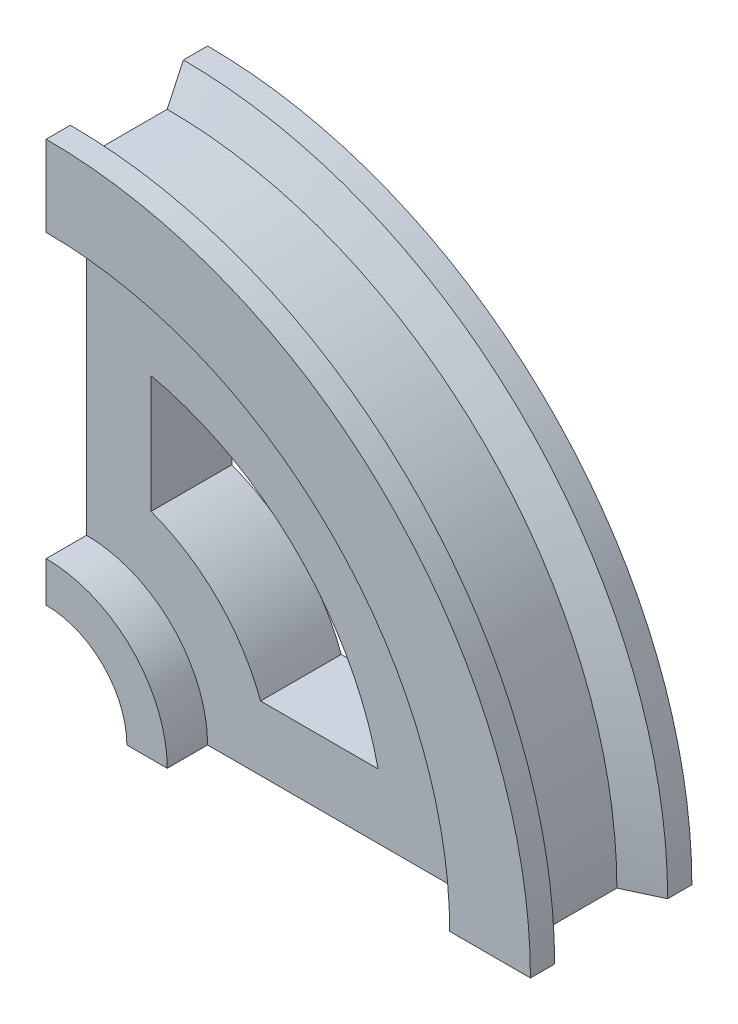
ISO-10303-21;
HEADER;
FILE_DESCRIPTION(('STEP AP214'),'2;1');
FILE_NAME('part.step','',(''),(''),'','','');
FILE_SCHEMA(('AUTOMOTIVE_DESIGN { 1 0 10303 214 1 1 1 1 }'));
ENDSEC;
DATA;
#1=APPLICATION_CONTEXT('core data for automotive mechanical design processes');
#2=APPLICATION_PROTOCOL_DEFINITION('international standard','automotive_design',2000,#1);
#3=PRODUCT_CONTEXT('',#1,'mechanical');
#4=PRODUCT('Part','Part','',(#3));
#5=PRODUCT_RELATED_PRODUCT_CATEGORY('part','',(#4));
#6=PRODUCT_DEFINITION_FORMATION('','',#4);
#7=PRODUCT_DEFINITION_CONTEXT('part definition',#1,'design');
#8=PRODUCT_DEFINITION('design','',#6,#7);
#9=PRODUCT_DEFINITION_SHAPE('','',#8);
#10=(LENGTH_UNIT() NAMED_UNIT(*) SI_UNIT(.MILLI.,.METRE.));
#11=(NAMED_UNIT(*) PLANE_ANGLE_UNIT() SI_UNIT($,.RADIAN.));
#12=(NAMED_UNIT(*) SI_UNIT($,.STERADIAN.) SOLID_ANGLE_UNIT());
#13=UNCERTAINTY_MEASURE_WITH_UNIT(LENGTH_MEASURE(1.E-05),#10,'distance_accuracy_value','');
#14=(GEOMETRIC_REPRESENTATION_CONTEXT(3) GLOBAL_UNCERTAINTY_ASSIGNED_CONTEXT((#13)) GLOBAL_UNIT_ASSIGNED_CONTEXT((#10,
#11,#12)) REPRESENTATION_CONTEXT('',''));
#15=CARTESIAN_POINT('',(0.,0.,0.));
#16=DIRECTION('',(0.,0.,1.));
#17=DIRECTION('',(1.,0.,0.));
#18=AXIS2_PLACEMENT_3D('',#15,#16,#17);
#19=CARTESIAN_POINT('',(15.,0.,10.));
#20=DIRECTION('',(0.,0.,-1.));
#21=DIRECTION('',(-1.,0.,0.));
#22=AXIS2_PLACEMENT_3D('',#19,#20,#21);
#23=PLANE('',#22);
#24=CARTESIAN_POINT('',(0.,0.,10.));
#25=DIRECTION('',(0.,0.,1.));
#26=DIRECTION('',(1.,0.,0.));
#27=AXIS2_PLACEMENT_3D('',#24,#25,#26);
#28=CIRCLE('',#27,10.);
#29=CARTESIAN_POINT('',(10.,0.,10.));
#30=VERTEX_POINT('',#29);
#31=CARTESIAN_POINT('',(0.,10.,10.));
#32=VERTEX_POINT('',#31);
#33=EDGE_CURVE('E11',#30,#32,#28,.T.);
#34=ORIENTED_EDGE('',*,*,#33,.F.);
#35=DIRECTION('',(-1.,0.,0.));
#36=VECTOR('',#35,1.);
#37=CARTESIAN_POINT('',(15.,0.,10.));
#38=LINE('',#37,#36);
#39=CARTESIAN_POINT('',(15.,0.,10.));
#40=VERTEX_POINT('',#39);
#41=EDGE_CURVE('E262',#40,#30,#38,.T.);
#42=ORIENTED_EDGE('',*,*,#41,.F.);
#43=CARTESIAN_POINT('',(0.,0.,10.));
#44=DIRECTION('',(0.,0.,1.));
#45=DIRECTION('',(1.,0.,0.));
#46=AXIS2_PLACEMENT_3D('',#43,#44,#45);
#47=CIRCLE('',#46,15.);
#48=CARTESIAN_POINT('',(0.,15.,10.));
#49=VERTEX_POINT('',#48);
#50=EDGE_CURVE('E310',#40,#49,#47,.T.);
#51=ORIENTED_EDGE('',*,*,#50,.T.);
#52=DIRECTION('',(0.,-1.,0.));
#53=VECTOR('',#52,1.);
#54=CARTESIAN_POINT('',(0.,15.,10.));
#55=LINE('',#54,#53);
#56=EDGE_CURVE('E211',#49,#32,#55,.T.);
#57=ORIENTED_EDGE('',*,*,#56,.T.);
#58=EDGE_LOOP('',(#34,#42,#51,#57));
#59=FACE_BOUND('',#58,.T.);
#60=ADVANCED_FACE('F42',(#59),#23,.F.);
#61=CARTESIAN_POINT('',(0.,0.,25.7403142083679));
#62=DIRECTION('',(0.,0.,1.));
#63=DIRECTION('',(1.,0.,0.));
#64=AXIS2_PLACEMENT_3D('',#61,#62,#63);
#65=CYLINDRICAL_SURFACE('',#64,10.);
#66=CARTESIAN_POINT('',(0.,0.,-10.));
#67=DIRECTION('',(0.,0.,1.));
#68=DIRECTION('',(1.,0.,0.));
#69=AXIS2_PLACEMENT_3D('',#66,#67,#68);
#70=CIRCLE('',#69,10.);
#71=CARTESIAN_POINT('',(10.,0.,-10.));
#72=VERTEX_POINT('',#71);
#73=CARTESIAN_POINT('',(0.,10.,-10.));
#74=VERTEX_POINT('',#73);
#75=EDGE_CURVE('E50',#72,#74,#70,.T.);
#76=ORIENTED_EDGE('',*,*,#75,.F.);
#77=DIRECTION('',(0.,0.,-1.));
#78=VECTOR('',#77,1.);
#79=CARTESIAN_POINT('',(10.,0.,10.));
#80=LINE('',#79,#78);
#81=EDGE_CURVE('E265',#30,#72,#80,.T.);
#82=ORIENTED_EDGE('',*,*,#81,.F.);
#83=ORIENTED_EDGE('',*,*,#33,.T.);
#84=DIRECTION('',(0.,0.,-1.));
#85=VECTOR('',#84,1.);
#86=CARTESIAN_POINT('',(0.,10.,10.));
#87=LINE('',#86,#85);
#88=EDGE_CURVE('E217',#32,#74,#87,.T.);
#89=ORIENTED_EDGE('',*,*,#88,.T.);
#90=EDGE_LOOP('',(#76,#82,#83,#89));
#91=FACE_BOUND('',#90,.T.);
#92=ADVANCED_FACE('F44',(#91),#65,.F.);
#93=CARTESIAN_POINT('',(15.,0.,-10.));
#94=DIRECTION('',(0.,0.,1.));
#95=DIRECTION('',(1.,0.,0.));
#96=AXIS2_PLACEMENT_3D('',#93,#94,#95);
#97=PLANE('',#96);
#98=CARTESIAN_POINT('',(0.,0.,-10.));
#99=DIRECTION('',(0.,0.,1.));
#100=DIRECTION('',(1.,0.,0.));
#101=AXIS2_PLACEMENT_3D('',#98,#99,#100);
#102=CIRCLE('',#101,15.);
#103=CARTESIAN_POINT('',(15.,0.,-10.));
#104=VERTEX_POINT('',#103);
#105=CARTESIAN_POINT('',(0.,15.,-10.));
#106=VERTEX_POINT('',#105);
#107=EDGE_CURVE('E336',#104,#106,#102,.T.);
#108=ORIENTED_EDGE('',*,*,#107,.F.);
#109=DIRECTION('',(1.,0.,0.));
#110=VECTOR('',#109,1.);
#111=CARTESIAN_POINT('',(15.,0.,-10.));
#112=LINE('',#111,#110);
#113=EDGE_CURVE('E268',#72,#104,#112,.T.);
#114=ORIENTED_EDGE('',*,*,#113,.F.);
#115=ORIENTED_EDGE('',*,*,#75,.T.);
#116=DIRECTION('',(0.,1.,0.));
#117=VECTOR('',#116,1.);
#118=CARTESIAN_POINT('',(0.,15.,-10.));
#119=LINE('',#118,#117);
#120=EDGE_CURVE('E220',#74,#106,#119,.T.);
#121=ORIENTED_EDGE('',*,*,#120,.T.);
#122=EDGE_LOOP('',(#108,#114,#115,#121));
#123=FACE_BOUND('',#122,.T.);
#124=ADVANCED_FACE('F339',(#123),#97,.F.);
#125=CARTESIAN_POINT('',(0.,0.,25.7403142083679));
#126=DIRECTION('',(0.,0.,1.));
#127=DIRECTION('',(1.,0.,0.));
#128=AXIS2_PLACEMENT_3D('',#125,#126,#127);
#129=CYLINDRICAL_SURFACE('',#128,15.);
#130=CARTESIAN_POINT('',(0.,0.,-5.));
#131=DIRECTION('',(0.,0.,1.));
#132=DIRECTION('',(1.,0.,0.));
#133=AXIS2_PLACEMENT_3D('',#130,#131,#132);
#134=CIRCLE('',#133,15.);
#135=CARTESIAN_POINT('',(15.,0.,-5.));
#136=VERTEX_POINT('',#135);
#137=CARTESIAN_POINT('',(0.,15.,-5.));
#138=VERTEX_POINT('',#137);
#139=EDGE_CURVE('E334',#136,#138,#134,.T.);
#140=ORIENTED_EDGE('',*,*,#139,.F.);
#141=DIRECTION('',(0.,0.,1.));
#142=VECTOR('',#141,1.);
#143=CARTESIAN_POINT('',(15.,0.,-5.));
#144=LINE('',#143,#142);
#145=EDGE_CURVE('E271',#104,#136,#144,.T.);
#146=ORIENTED_EDGE('',*,*,#145,.F.);
#147=ORIENTED_EDGE('',*,*,#107,.T.);
#148=DIRECTION('',(0.,0.,1.));
#149=VECTOR('',#148,1.);
#150=CARTESIAN_POINT('',(0.,15.,-5.));
#151=LINE('',#150,#149);
#152=EDGE_CURVE('E223',#106,#138,#151,.T.);
#153=ORIENTED_EDGE('',*,*,#152,.T.);
#154=EDGE_LOOP('',(#140,#146,#147,#153));
#155=FACE_BOUND('',#154,.T.);
#156=ADVANCED_FACE('F351',(#155),#129,.T.);
#157=CARTESIAN_POINT('',(15.,0.,-5.));
#158=DIRECTION('',(0.,0.,1.));
#159=DIRECTION('',(1.,0.,0.));
#160=AXIS2_PLACEMENT_3D('',#157,#158,#159);
#161=PLANE('',#160);
#162=DIRECTION('',(-1.,0.,0.));
#163=VECTOR('',#162,1.);
#164=CARTESIAN_POINT('',(36.1247837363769,7.99999999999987,-5.));
#165=LINE('',#164,#163);
#166=CARTESIAN_POINT('',(36.1247837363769,7.99999999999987,-5.));
#167=VERTEX_POINT('',#166);
#168=CARTESIAN_POINT('',(21.5638586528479,7.99999999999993,-5.));
#169=VERTEX_POINT('',#168);
#170=EDGE_CURVE('E205',#167,#169,#165,.T.);
#171=ORIENTED_EDGE('',*,*,#170,.F.);
#172=CARTESIAN_POINT('',(0.,0.,-5.));
#173=DIRECTION('',(0.,0.,-1.));
#174=DIRECTION('',(-1.,0.,0.));
#175=AXIS2_PLACEMENT_3D('',#172,#173,#174);
#176=CIRCLE('',#175,37.);
#177=CARTESIAN_POINT('',(8.,36.1247837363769,-5.));
#178=VERTEX_POINT('',#177);
#179=EDGE_CURVE('E57',#178,#167,#176,.T.);
#180=ORIENTED_EDGE('',*,*,#179,.F.);
#181=DIRECTION('',(0.,1.,0.));
#182=VECTOR('',#181,1.);
#183=CARTESIAN_POINT('',(8.,21.5638586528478,-5.));
#184=LINE('',#183,#182);
#185=CARTESIAN_POINT('',(8.,21.5638586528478,-5.));
#186=VERTEX_POINT('',#185);
#187=EDGE_CURVE('E196',#186,#178,#184,.T.);
#188=ORIENTED_EDGE('',*,*,#187,.F.);
#189=CARTESIAN_POINT('',(0.,0.,-5.));
#190=DIRECTION('',(0.,0.,1.));
#191=DIRECTION('',(-1.,0.,0.));
#192=AXIS2_PLACEMENT_3D('',#189,#190,#191);
#193=CIRCLE('',#192,23.);
#194=EDGE_CURVE('E199',#169,#186,#193,.T.);
#195=ORIENTED_EDGE('',*,*,#194,.F.);
#196=EDGE_LOOP('',(#171,#180,#188,#195));
#197=FACE_BOUND('',#196,.T.);
#198=CARTESIAN_POINT('',(0.,0.,-5.));
#199=DIRECTION('',(0.,0.,1.));
#200=DIRECTION('',(1.,0.,0.));
#201=AXIS2_PLACEMENT_3D('',#198,#199,#200);
#202=CIRCLE('',#201,45.);
#203=CARTESIAN_POINT('',(45.,-1.57116660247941E-13,-5.));
#204=VERTEX_POINT('',#203);
#205=CARTESIAN_POINT('',(0.,45.,-5.));
#206=VERTEX_POINT('',#205);
#207=EDGE_CURVE('E332',#204,#206,#202,.T.);
#208=ORIENTED_EDGE('',*,*,#207,.F.);
#209=DIRECTION('',(1.,0.,0.));
#210=VECTOR('',#209,1.);
#211=CARTESIAN_POINT('',(15.,0.,-5.));
#212=LINE('',#211,#210);
#213=EDGE_CURVE('E274',#136,#204,#212,.T.);
#214=ORIENTED_EDGE('',*,*,#213,.F.);
#215=ORIENTED_EDGE('',*,*,#139,.T.);
#216=DIRECTION('',(0.,1.,0.));
#217=VECTOR('',#216,1.);
#218=CARTESIAN_POINT('',(0.,15.,-5.));
#219=LINE('',#218,#217);
#220=EDGE_CURVE('E226',#138,#206,#219,.T.);
#221=ORIENTED_EDGE('',*,*,#220,.T.);
#222=EDGE_LOOP('',(#208,#214,#215,#221));
#223=FACE_BOUND('',#222,.T.);
#224=ADVANCED_FACE('F400',(#197,#223),#161,.F.);
#225=CARTESIAN_POINT('',(0.,0.,-5.));
#226=DIRECTION('',(0.,0.,-1.));
#227=DIRECTION('',(-1.,0.,0.));
#228=AXIS2_PLACEMENT_3D('',#225,#226,#227);
#229=CONICAL_SURFACE('',#228,45.,0.785398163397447);
#230=CARTESIAN_POINT('',(0.,0.,-10.));
#231=DIRECTION('',(0.,0.,1.));
#232=DIRECTION('',(1.,0.,0.));
#233=AXIS2_PLACEMENT_3D('',#230,#231,#232);
#234=CIRCLE('',#233,50.);
#235=CARTESIAN_POINT('',(50.,-1.74574066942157E-13,-10.));
#236=VERTEX_POINT('',#235);
#237=CARTESIAN_POINT('',(0.,50.,-10.));
#238=VERTEX_POINT('',#237);
#239=EDGE_CURVE('E330',#236,#238,#234,.T.);
#240=ORIENTED_EDGE('',*,*,#239,.F.);
#241=DIRECTION('',(0.707106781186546,0.,-0.707106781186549));
#242=VECTOR('',#241,1.);
#243=CARTESIAN_POINT('',(45.,-1.57116660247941E-13,-5.));
#244=LINE('',#243,#242);
#245=EDGE_CURVE('E277',#204,#236,#244,.T.);
#246=ORIENTED_EDGE('',*,*,#245,.F.);
#247=ORIENTED_EDGE('',*,*,#207,.T.);
#248=DIRECTION('',(0.,0.707106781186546,-0.707106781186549));
#249=VECTOR('',#248,1.);
#250=CARTESIAN_POINT('',(0.,45.,-5.));
#251=LINE('',#250,#249);
#252=EDGE_CURVE('E229',#206,#238,#251,.T.);
#253=ORIENTED_EDGE('',*,*,#252,.T.);
#254=EDGE_LOOP('',(#240,#246,#247,#253));
#255=FACE_BOUND('',#254,.T.);
#256=ADVANCED_FACE('F398',(#255),#229,.F.);
#257=CARTESIAN_POINT('',(50.,-1.74574066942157E-13,-10.));
#258=DIRECTION('',(0.,0.,1.));
#259=DIRECTION('',(1.,0.,0.));
#260=AXIS2_PLACEMENT_3D('',#257,#258,#259);
#261=PLANE('',#260);
#262=CARTESIAN_POINT('',(0.,0.,-10.));
#263=DIRECTION('',(0.,0.,1.));
#264=DIRECTION('',(1.,0.,0.));
#265=AXIS2_PLACEMENT_3D('',#262,#263,#264);
#266=CIRCLE('',#265,60.);
#267=CARTESIAN_POINT('',(60.,-2.09488880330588E-13,-10.));
#268=VERTEX_POINT('',#267);
#269=CARTESIAN_POINT('',(0.,60.,-10.));
#270=VERTEX_POINT('',#269);
#271=EDGE_CURVE('E328',#268,#270,#266,.T.);
#272=ORIENTED_EDGE('',*,*,#271,.F.);
#273=DIRECTION('',(1.,0.,0.));
#274=VECTOR('',#273,1.);
#275=CARTESIAN_POINT('',(50.,-1.74574066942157E-13,-10.));
#276=LINE('',#275,#274);
#277=EDGE_CURVE('E280',#236,#268,#276,.T.);
#278=ORIENTED_EDGE('',*,*,#277,.F.);
#279=ORIENTED_EDGE('',*,*,#239,.T.);
#280=DIRECTION('',(0.,1.,0.));
#281=VECTOR('',#280,1.);
#282=CARTESIAN_POINT('',(0.,50.,-10.));
#283=LINE('',#282,#281);
#284=EDGE_CURVE('E232',#238,#270,#283,.T.);
#285=ORIENTED_EDGE('',*,*,#284,.T.);
#286=EDGE_LOOP('',(#272,#278,#279,#285));
#287=FACE_BOUND('',#286,.T.);
#288=ADVANCED_FACE('F395',(#287),#261,.F.);
#289=CARTESIAN_POINT('',(0.,0.,25.7403142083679));
#290=DIRECTION('',(0.,0.,1.));
#291=DIRECTION('',(1.,0.,0.));
#292=AXIS2_PLACEMENT_3D('',#289,#290,#291);
#293=CYLINDRICAL_SURFACE('',#292,60.);
#294=CARTESIAN_POINT('',(0.,0.,-7.00000000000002));
#295=DIRECTION('',(0.,0.,1.));
#296=DIRECTION('',(1.,0.,0.));
#297=AXIS2_PLACEMENT_3D('',#294,#295,#296);
#298=CIRCLE('',#297,60.);
#299=CARTESIAN_POINT('',(60.,-2.09488880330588E-13,-7.00000000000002));
#300=VERTEX_POINT('',#299);
#301=CARTESIAN_POINT('',(0.,60.,-7.00000000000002));
#302=VERTEX_POINT('',#301);
#303=EDGE_CURVE('E326',#300,#302,#298,.T.);
#304=ORIENTED_EDGE('',*,*,#303,.F.);
#305=DIRECTION('',(0.,0.,1.));
#306=VECTOR('',#305,1.);
#307=CARTESIAN_POINT('',(60.,-2.09488880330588E-13,-10.));
#308=LINE('',#307,#306);
#309=EDGE_CURVE('E283',#268,#300,#308,.T.);
#310=ORIENTED_EDGE('',*,*,#309,.F.);
#311=ORIENTED_EDGE('',*,*,#271,.T.);
#312=DIRECTION('',(0.,0.,1.));
#313=VECTOR('',#312,1.);
#314=CARTESIAN_POINT('',(0.,60.,-10.));
#315=LINE('',#314,#313);
#316=EDGE_CURVE('E235',#270,#302,#315,.T.);
#317=ORIENTED_EDGE('',*,*,#316,.T.);
#318=EDGE_LOOP('',(#304,#310,#311,#317));
#319=FACE_BOUND('',#318,.T.);
#320=ADVANCED_FACE('F391',(#319),#293,.T.);
#321=CARTESIAN_POINT('',(0.,0.,-7.00000000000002));
#322=DIRECTION('',(0.,0.,-1.));
#323=DIRECTION('',(-1.,0.,0.));
#324=AXIS2_PLACEMENT_3D('',#321,#322,#323);
#325=CONICAL_SURFACE('',#324,60.,1.13446401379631);
#326=CARTESIAN_POINT('',(0.,0.,-5.));
#327=DIRECTION('',(0.,0.,1.));
#328=DIRECTION('',(1.,0.,0.));
#329=AXIS2_PLACEMENT_3D('',#326,#327,#328);
#330=CIRCLE('',#329,55.7109861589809);
#331=CARTESIAN_POINT('',(55.7109861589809,-1.9451386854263E-13,-5.));
#332=VERTEX_POINT('',#331);
#333=CARTESIAN_POINT('',(0.,55.7109861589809,-5.));
#334=VERTEX_POINT('',#333);
#335=EDGE_CURVE('E324',#332,#334,#330,.T.);
#336=ORIENTED_EDGE('',*,*,#335,.F.);
#337=DIRECTION('',(-0.906307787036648,0.,0.422618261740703));
#338=VECTOR('',#337,1.);
#339=CARTESIAN_POINT('',(60.,-2.09488880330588E-13,-7.00000000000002));
#340=LINE('',#339,#338);
#341=EDGE_CURVE('E286',#300,#332,#340,.T.);
#342=ORIENTED_EDGE('',*,*,#341,.F.);
#343=ORIENTED_EDGE('',*,*,#303,.T.);
#344=DIRECTION('',(0.,-0.906307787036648,0.422618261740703));
#345=VECTOR('',#344,1.);
#346=CARTESIAN_POINT('',(0.,60.,-7.00000000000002));
#347=LINE('',#346,#345);
#348=EDGE_CURVE('E238',#302,#334,#347,.T.);
#349=ORIENTED_EDGE('',*,*,#348,.T.);
#350=EDGE_LOOP('',(#336,#342,#343,#349));
#351=FACE_BOUND('',#350,.T.);
#352=ADVANCED_FACE('F387',(#351),#325,.T.);
#353=CARTESIAN_POINT('',(0.,0.,25.7403142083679));
#354=DIRECTION('',(0.,0.,1.));
#355=DIRECTION('',(1.,0.,0.));
#356=AXIS2_PLACEMENT_3D('',#353,#354,#355);
#357=CYLINDRICAL_SURFACE('',#356,55.7109861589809);
#358=CARTESIAN_POINT('',(0.,0.,5.));
#359=DIRECTION('',(0.,0.,1.));
#360=DIRECTION('',(1.,0.,0.));
#361=AXIS2_PLACEMENT_3D('',#358,#359,#360);
#362=CIRCLE('',#361,55.7109861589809);
#363=CARTESIAN_POINT('',(55.7109861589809,-1.9451386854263E-13,5.));
#364=VERTEX_POINT('',#363);
#365=CARTESIAN_POINT('',(0.,55.7109861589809,5.));
#366=VERTEX_POINT('',#365);
#367=EDGE_CURVE('E322',#364,#366,#362,.T.);
#368=ORIENTED_EDGE('',*,*,#367,.F.);
#369=DIRECTION('',(0.,0.,1.));
#370=VECTOR('',#369,1.);
#371=CARTESIAN_POINT('',(55.7109861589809,-1.9451386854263E-13,5.));
#372=LINE('',#371,#370);
#373=EDGE_CURVE('E289',#332,#364,#372,.T.);
#374=ORIENTED_EDGE('',*,*,#373,.F.);
#375=ORIENTED_EDGE('',*,*,#335,.T.);
#376=DIRECTION('',(0.,0.,1.));
#377=VECTOR('',#376,1.);
#378=CARTESIAN_POINT('',(0.,55.7109861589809,5.));
#379=LINE('',#378,#377);
#380=EDGE_CURVE('E241',#334,#366,#379,.T.);
#381=ORIENTED_EDGE('',*,*,#380,.T.);
#382=EDGE_LOOP('',(#368,#374,#375,#381));
#383=FACE_BOUND('',#382,.T.);
#384=ADVANCED_FACE('F384',(#383),#357,.T.);
#385=CARTESIAN_POINT('',(0.,0.,5.));
#386=DIRECTION('',(0.,0.,1.));
#387=DIRECTION('',(1.,0.,0.));
#388=AXIS2_PLACEMENT_3D('',#385,#386,#387);
#389=CONICAL_SURFACE('',#388,55.7109861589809,1.13446401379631);
#390=CARTESIAN_POINT('',(0.,0.,7.00000000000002));
#391=DIRECTION('',(0.,0.,1.));
#392=DIRECTION('',(1.,0.,0.));
#393=AXIS2_PLACEMENT_3D('',#390,#391,#392);
#394=CIRCLE('',#393,60.);
#395=CARTESIAN_POINT('',(60.,-2.09488880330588E-13,7.00000000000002));
#396=VERTEX_POINT('',#395);
#397=CARTESIAN_POINT('',(0.,60.,7.00000000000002));
#398=VERTEX_POINT('',#397);
#399=EDGE_CURVE('E320',#396,#398,#394,.T.);
#400=ORIENTED_EDGE('',*,*,#399,.F.);
#401=DIRECTION('',(0.906307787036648,0.,0.422618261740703));
#402=VECTOR('',#401,1.);
#403=CARTESIAN_POINT('',(60.,-2.09488880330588E-13,7.00000000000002));
#404=LINE('',#403,#402);
#405=EDGE_CURVE('E292',#364,#396,#404,.T.);
#406=ORIENTED_EDGE('',*,*,#405,.F.);
#407=ORIENTED_EDGE('',*,*,#367,.T.);
#408=DIRECTION('',(0.,0.906307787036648,0.422618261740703));
#409=VECTOR('',#408,1.);
#410=CARTESIAN_POINT('',(0.,60.,7.00000000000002));
#411=LINE('',#410,#409);
#412=EDGE_CURVE('E244',#366,#398,#411,.T.);
#413=ORIENTED_EDGE('',*,*,#412,.T.);
#414=EDGE_LOOP('',(#400,#406,#407,#413));
#415=FACE_BOUND('',#414,.T.);
#416=ADVANCED_FACE('F380',(#415),#389,.T.);
#417=CARTESIAN_POINT('',(0.,0.,25.7403142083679));
#418=DIRECTION('',(0.,0.,1.));
#419=DIRECTION('',(1.,0.,0.));
#420=AXIS2_PLACEMENT_3D('',#417,#418,#419);
#421=CYLINDRICAL_SURFACE('',#420,60.);
#422=CARTESIAN_POINT('',(0.,0.,10.));
#423=DIRECTION('',(0.,0.,1.));
#424=DIRECTION('',(1.,0.,0.));
#425=AXIS2_PLACEMENT_3D('',#422,#423,#424);
#426=CIRCLE('',#425,60.);
#427=CARTESIAN_POINT('',(60.,-2.09488880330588E-13,10.));
#428=VERTEX_POINT('',#427);
#429=CARTESIAN_POINT('',(0.,60.,10.));
#430=VERTEX_POINT('',#429);
#431=EDGE_CURVE('E318',#428,#430,#426,.T.);
#432=ORIENTED_EDGE('',*,*,#431,.F.);
#433=DIRECTION('',(0.,0.,1.));
#434=VECTOR('',#433,1.);
#435=CARTESIAN_POINT('',(60.,-2.09488880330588E-13,10.));
#436=LINE('',#435,#434);
#437=EDGE_CURVE('E295',#396,#428,#436,.T.);
#438=ORIENTED_EDGE('',*,*,#437,.F.);
#439=ORIENTED_EDGE('',*,*,#399,.T.);
#440=DIRECTION('',(0.,0.,1.));
#441=VECTOR('',#440,1.);
#442=CARTESIAN_POINT('',(0.,60.,10.));
#443=LINE('',#442,#441);
#444=EDGE_CURVE('E247',#398,#430,#443,.T.);
#445=ORIENTED_EDGE('',*,*,#444,.T.);
#446=EDGE_LOOP('',(#432,#438,#439,#445));
#447=FACE_BOUND('',#446,.T.);
#448=ADVANCED_FACE('F375',(#447),#421,.T.);
#449=CARTESIAN_POINT('',(50.,-1.74574066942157E-13,10.));
#450=DIRECTION('',(0.,0.,-1.));
#451=DIRECTION('',(-1.,0.,0.));
#452=AXIS2_PLACEMENT_3D('',#449,#450,#451);
#453=PLANE('',#452);
#454=CARTESIAN_POINT('',(0.,0.,10.));
#455=DIRECTION('',(0.,0.,1.));
#456=DIRECTION('',(1.,0.,0.));
#457=AXIS2_PLACEMENT_3D('',#454,#455,#456);
#458=CIRCLE('',#457,50.);
#459=CARTESIAN_POINT('',(50.,-1.74574066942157E-13,10.));
#460=VERTEX_POINT('',#459);
#461=CARTESIAN_POINT('',(0.,50.,10.));
#462=VERTEX_POINT('',#461);
#463=EDGE_CURVE('E316',#460,#462,#458,.T.);
#464=ORIENTED_EDGE('',*,*,#463,.F.);
#465=DIRECTION('',(-1.,0.,0.));
#466=VECTOR('',#465,1.);
#467=CARTESIAN_POINT('',(50.,-1.74574066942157E-13,10.));
#468=LINE('',#467,#466);
#469=EDGE_CURVE('E298',#428,#460,#468,.T.);
#470=ORIENTED_EDGE('',*,*,#469,.F.);
#471=ORIENTED_EDGE('',*,*,#431,.T.);
#472=DIRECTION('',(0.,-1.,0.));
#473=VECTOR('',#472,1.);
#474=CARTESIAN_POINT('',(0.,50.,10.));
#475=LINE('',#474,#473);
#476=EDGE_CURVE('E250',#430,#462,#475,.T.);
#477=ORIENTED_EDGE('',*,*,#476,.T.);
#478=EDGE_LOOP('',(#464,#470,#471,#477));
#479=FACE_BOUND('',#478,.T.);
#480=ADVANCED_FACE('F372',(#479),#453,.F.);
#481=CARTESIAN_POINT('',(0.,0.,10.));
#482=DIRECTION('',(0.,0.,1.));
#483=DIRECTION('',(1.,0.,0.));
#484=AXIS2_PLACEMENT_3D('',#481,#482,#483);
#485=CONICAL_SURFACE('',#484,50.,0.785398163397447);
#486=CARTESIAN_POINT('',(0.,0.,5.));
#487=DIRECTION('',(0.,0.,1.));
#488=DIRECTION('',(1.,0.,0.));
#489=AXIS2_PLACEMENT_3D('',#486,#487,#488);
#490=CIRCLE('',#489,45.);
#491=CARTESIAN_POINT('',(45.,-1.57116660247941E-13,5.));
#492=VERTEX_POINT('',#491);
#493=CARTESIAN_POINT('',(0.,45.,5.));
#494=VERTEX_POINT('',#493);
#495=EDGE_CURVE('E314',#492,#494,#490,.T.);
#496=ORIENTED_EDGE('',*,*,#495,.F.);
#497=DIRECTION('',(-0.707106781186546,0.,-0.707106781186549));
#498=VECTOR('',#497,1.);
#499=CARTESIAN_POINT('',(45.,-1.57116660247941E-13,5.));
#500=LINE('',#499,#498);
#501=EDGE_CURVE('E301',#460,#492,#500,.T.);
#502=ORIENTED_EDGE('',*,*,#501,.F.);
#503=ORIENTED_EDGE('',*,*,#463,.T.);
#504=DIRECTION('',(0.,-0.707106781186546,-0.707106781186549));
#505=VECTOR('',#504,1.);
#506=CARTESIAN_POINT('',(0.,45.,5.));
#507=LINE('',#506,#505);
#508=EDGE_CURVE('E253',#462,#494,#507,.T.);
#509=ORIENTED_EDGE('',*,*,#508,.T.);
#510=EDGE_LOOP('',(#496,#502,#503,#509));
#511=FACE_BOUND('',#510,.T.);
#512=ADVANCED_FACE('F368',(#511),#485,.F.);
#513=CARTESIAN_POINT('',(15.,0.,5.));
#514=DIRECTION('',(0.,0.,-1.));
#515=DIRECTION('',(-1.,0.,0.));
#516=AXIS2_PLACEMENT_3D('',#513,#514,#515);
#517=PLANE('',#516);
#518=DIRECTION('',(0.,1.,0.));
#519=VECTOR('',#518,1.);
#520=CARTESIAN_POINT('',(8.,21.5638586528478,5.));
#521=LINE('',#520,#519);
#522=CARTESIAN_POINT('',(8.,21.5638586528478,5.));
#523=VERTEX_POINT('',#522);
#524=CARTESIAN_POINT('',(8.,36.1247837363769,5.));
#525=VERTEX_POINT('',#524);
#526=EDGE_CURVE('E186',#523,#525,#521,.T.);
#527=ORIENTED_EDGE('',*,*,#526,.T.);
#528=CARTESIAN_POINT('',(0.,0.,5.));
#529=DIRECTION('',(0.,0.,-1.));
#530=DIRECTION('',(-1.,0.,0.));
#531=AXIS2_PLACEMENT_3D('',#528,#529,#530);
#532=CIRCLE('',#531,37.);
#533=CARTESIAN_POINT('',(36.1247837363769,7.99999999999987,5.));
#534=VERTEX_POINT('',#533);
#535=EDGE_CURVE('E180',#525,#534,#532,.T.);
#536=ORIENTED_EDGE('',*,*,#535,.T.);
#537=DIRECTION('',(-1.,0.,0.));
#538=VECTOR('',#537,1.);
#539=CARTESIAN_POINT('',(36.1247837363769,7.99999999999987,5.));
#540=LINE('',#539,#538);
#541=CARTESIAN_POINT('',(21.5638586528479,7.99999999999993,5.));
#542=VERTEX_POINT('',#541);
#543=EDGE_CURVE('E189',#534,#542,#540,.T.);
#544=ORIENTED_EDGE('',*,*,#543,.T.);
#545=CARTESIAN_POINT('',(0.,0.,5.));
#546=DIRECTION('',(0.,0.,1.));
#547=DIRECTION('',(-1.,0.,0.));
#548=AXIS2_PLACEMENT_3D('',#545,#546,#547);
#549=CIRCLE('',#548,23.);
#550=EDGE_CURVE('E65',#542,#523,#549,.T.);
#551=ORIENTED_EDGE('',*,*,#550,.T.);
#552=EDGE_LOOP('',(#527,#536,#544,#551));
#553=FACE_BOUND('',#552,.T.);
#554=CARTESIAN_POINT('',(0.,0.,5.));
#555=DIRECTION('',(0.,0.,1.));
#556=DIRECTION('',(1.,0.,0.));
#557=AXIS2_PLACEMENT_3D('',#554,#555,#556);
#558=CIRCLE('',#557,15.);
#559=CARTESIAN_POINT('',(15.,0.,5.));
#560=VERTEX_POINT('',#559);
#561=CARTESIAN_POINT('',(0.,15.,5.));
#562=VERTEX_POINT('',#561);
#563=EDGE_CURVE('E312',#560,#562,#558,.T.);
#564=ORIENTED_EDGE('',*,*,#563,.F.);
#565=DIRECTION('',(-1.,0.,0.));
#566=VECTOR('',#565,1.);
#567=CARTESIAN_POINT('',(15.,0.,5.));
#568=LINE('',#567,#566);
#569=EDGE_CURVE('E304',#492,#560,#568,.T.);
#570=ORIENTED_EDGE('',*,*,#569,.F.);
#571=ORIENTED_EDGE('',*,*,#495,.T.);
#572=DIRECTION('',(0.,-1.,0.));
#573=VECTOR('',#572,1.);
#574=CARTESIAN_POINT('',(0.,15.,5.));
#575=LINE('',#574,#573);
#576=EDGE_CURVE('E256',#494,#562,#575,.T.);
#577=ORIENTED_EDGE('',*,*,#576,.T.);
#578=EDGE_LOOP('',(#564,#570,#571,#577));
#579=FACE_BOUND('',#578,.T.);
#580=ADVANCED_FACE('F193',(#553,#579),#517,.F.);
#581=CARTESIAN_POINT('',(0.,0.,25.7403142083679));
#582=DIRECTION('',(0.,0.,1.));
#583=DIRECTION('',(1.,0.,0.));
#584=AXIS2_PLACEMENT_3D('',#581,#582,#583);
#585=CYLINDRICAL_SURFACE('',#584,15.);
#586=DIRECTION('',(0.,0.,1.));
#587=VECTOR('',#586,1.);
#588=CARTESIAN_POINT('',(15.,0.,10.));
#589=LINE('',#588,#587);
#590=EDGE_CURVE('E307',#560,#40,#589,.T.);
#591=ORIENTED_EDGE('',*,*,#590,.F.);
#592=ORIENTED_EDGE('',*,*,#563,.T.);
#593=DIRECTION('',(0.,0.,1.));
#594=VECTOR('',#593,1.);
#595=CARTESIAN_POINT('',(0.,15.,10.));
#596=LINE('',#595,#594);
#597=EDGE_CURVE('E259',#562,#49,#596,.T.);
#598=ORIENTED_EDGE('',*,*,#597,.T.);
#599=ORIENTED_EDGE('',*,*,#50,.F.);
#600=EDGE_LOOP('',(#591,#592,#598,#599));
#601=FACE_BOUND('',#600,.T.);
#602=ADVANCED_FACE('F362',(#601),#585,.T.);
#603=CARTESIAN_POINT('',(0.,0.,0.));
#604=DIRECTION('',(0.,-1.,0.));
#605=DIRECTION('',(0.,0.,-1.));
#606=AXIS2_PLACEMENT_3D('',#603,#604,#605);
#607=PLANE('',#606);
#608=ORIENTED_EDGE('',*,*,#41,.T.);
#609=ORIENTED_EDGE('',*,*,#81,.T.);
#610=ORIENTED_EDGE('',*,*,#113,.T.);
#611=ORIENTED_EDGE('',*,*,#145,.T.);
#612=ORIENTED_EDGE('',*,*,#213,.T.);
#613=ORIENTED_EDGE('',*,*,#245,.T.);
#614=ORIENTED_EDGE('',*,*,#277,.T.);
#615=ORIENTED_EDGE('',*,*,#309,.T.);
#616=ORIENTED_EDGE('',*,*,#341,.T.);
#617=ORIENTED_EDGE('',*,*,#373,.T.);
#618=ORIENTED_EDGE('',*,*,#405,.T.);
#619=ORIENTED_EDGE('',*,*,#437,.T.);
#620=ORIENTED_EDGE('',*,*,#469,.T.);
#621=ORIENTED_EDGE('',*,*,#501,.T.);
#622=ORIENTED_EDGE('',*,*,#569,.T.);
#623=ORIENTED_EDGE('',*,*,#590,.T.);
#624=EDGE_LOOP('',(#608,#609,#610,#611,#612,#613,#614,#615,#616,#617,#618,#619,#620,#621,#622,#623));
#625=FACE_BOUND('',#624,.T.);
#626=ADVANCED_FACE('F354',(#625),#607,.T.);
#627=CARTESIAN_POINT('',(0.,0.,0.));
#628=DIRECTION('',(1.,0.,0.));
#629=DIRECTION('',(0.,0.,-1.));
#630=AXIS2_PLACEMENT_3D('',#627,#628,#629);
#631=PLANE('',#630);
#632=ORIENTED_EDGE('',*,*,#56,.F.);
#633=ORIENTED_EDGE('',*,*,#597,.F.);
#634=ORIENTED_EDGE('',*,*,#576,.F.);
#635=ORIENTED_EDGE('',*,*,#508,.F.);
#636=ORIENTED_EDGE('',*,*,#476,.F.);
#637=ORIENTED_EDGE('',*,*,#444,.F.);
#638=ORIENTED_EDGE('',*,*,#412,.F.);
#639=ORIENTED_EDGE('',*,*,#380,.F.);
#640=ORIENTED_EDGE('',*,*,#348,.F.);
#641=ORIENTED_EDGE('',*,*,#316,.F.);
#642=ORIENTED_EDGE('',*,*,#284,.F.);
#643=ORIENTED_EDGE('',*,*,#252,.F.);
#644=ORIENTED_EDGE('',*,*,#220,.F.);
#645=ORIENTED_EDGE('',*,*,#152,.F.);
#646=ORIENTED_EDGE('',*,*,#120,.F.);
#647=ORIENTED_EDGE('',*,*,#88,.F.);
#648=EDGE_LOOP('',(#632,#633,#634,#635,#636,#637,#638,#639,#640,#641,#642,#643,#644,#645,#646,#647));
#649=FACE_BOUND('',#648,.T.);
#650=ADVANCED_FACE('F347',(#649),#631,.F.);
#651=CARTESIAN_POINT('',(0.,0.,5.));
#652=DIRECTION('',(0.,0.,-1.));
#653=DIRECTION('',(-1.,0.,0.));
#654=AXIS2_PLACEMENT_3D('',#651,#652,#653);
#655=CYLINDRICAL_SURFACE('',#654,37.);
#656=ORIENTED_EDGE('',*,*,#179,.T.);
#657=DIRECTION('',(0.,0.,-1.));
#658=VECTOR('',#657,1.);
#659=CARTESIAN_POINT('',(36.1247837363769,7.99999999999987,5.));
#660=LINE('',#659,#658);
#661=EDGE_CURVE('E176',#534,#167,#660,.T.);
#662=ORIENTED_EDGE('',*,*,#661,.F.);
#663=ORIENTED_EDGE('',*,*,#535,.F.);
#664=DIRECTION('',(0.,0.,-1.));
#665=VECTOR('',#664,1.);
#666=CARTESIAN_POINT('',(8.,36.1247837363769,5.));
#667=LINE('',#666,#665);
#668=EDGE_CURVE('E209',#525,#178,#667,.T.);
#669=ORIENTED_EDGE('',*,*,#668,.T.);
#670=EDGE_LOOP('',(#656,#662,#663,#669));
#671=FACE_BOUND('',#670,.T.);
#672=ADVANCED_FACE('F178',(#671),#655,.F.);
#673=CARTESIAN_POINT('',(8.,21.5638586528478,5.));
#674=DIRECTION('',(-1.,0.,0.));
#675=DIRECTION('',(0.,0.,1.));
#676=AXIS2_PLACEMENT_3D('',#673,#674,#675);
#677=PLANE('',#676);
#678=ORIENTED_EDGE('',*,*,#187,.T.);
#679=ORIENTED_EDGE('',*,*,#668,.F.);
#680=ORIENTED_EDGE('',*,*,#526,.F.);
#681=DIRECTION('',(0.,0.,-1.));
#682=VECTOR('',#681,1.);
#683=CARTESIAN_POINT('',(8.,21.5638586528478,5.));
#684=LINE('',#683,#682);
#685=EDGE_CURVE('E212',#523,#186,#684,.T.);
#686=ORIENTED_EDGE('',*,*,#685,.T.);
#687=EDGE_LOOP('',(#678,#679,#680,#686));
#688=FACE_BOUND('',#687,.T.);
#689=ADVANCED_FACE('F481',(#688),#677,.F.);
#690=CARTESIAN_POINT('',(0.,0.,5.));
#691=DIRECTION('',(0.,0.,-1.));
#692=DIRECTION('',(-1.,0.,0.));
#693=AXIS2_PLACEMENT_3D('',#690,#691,#692);
#694=CYLINDRICAL_SURFACE('',#693,23.);
#695=ORIENTED_EDGE('',*,*,#194,.T.);
#696=ORIENTED_EDGE('',*,*,#685,.F.);
#697=ORIENTED_EDGE('',*,*,#550,.F.);
#698=DIRECTION('',(0.,0.,-1.));
#699=VECTOR('',#698,1.);
#700=CARTESIAN_POINT('',(21.5638586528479,7.99999999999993,5.));
#701=LINE('',#700,#699);
#702=EDGE_CURVE('E185',#542,#169,#701,.T.);
#703=ORIENTED_EDGE('',*,*,#702,.T.);
#704=EDGE_LOOP('',(#695,#696,#697,#703));
#705=FACE_BOUND('',#704,.T.);
#706=ADVANCED_FACE('F487',(#705),#694,.T.);
#707=CARTESIAN_POINT('',(36.1247837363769,7.99999999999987,5.));
#708=DIRECTION('',(0.,-1.,0.));
#709=DIRECTION('',(1.,0.,0.));
#710=AXIS2_PLACEMENT_3D('',#707,#708,#709);
#711=PLANE('',#710);
#712=ORIENTED_EDGE('',*,*,#170,.T.);
#713=ORIENTED_EDGE('',*,*,#702,.F.);
#714=ORIENTED_EDGE('',*,*,#543,.F.);
#715=ORIENTED_EDGE('',*,*,#661,.T.);
#716=EDGE_LOOP('',(#712,#713,#714,#715));
#717=FACE_BOUND('',#716,.T.);
#718=ADVANCED_FACE('F190',(#717),#711,.F.);
#719=CLOSED_SHELL('',(#60,#92,#124,#156,#224,#256,#288,#320,#352,#384,#416,#448,#480,#512,#580,
#602,#626,#650,#672,#689,#706,#718));
#720=MANIFOLD_SOLID_BREP('B2',#719);
#721=ADVANCED_BREP_SHAPE_REPRESENTATION('',(#18,#720),#14);
#722=SHAPE_DEFINITION_REPRESENTATION(#9,#721);
ENDSEC;
END-ISO-10303-21;
